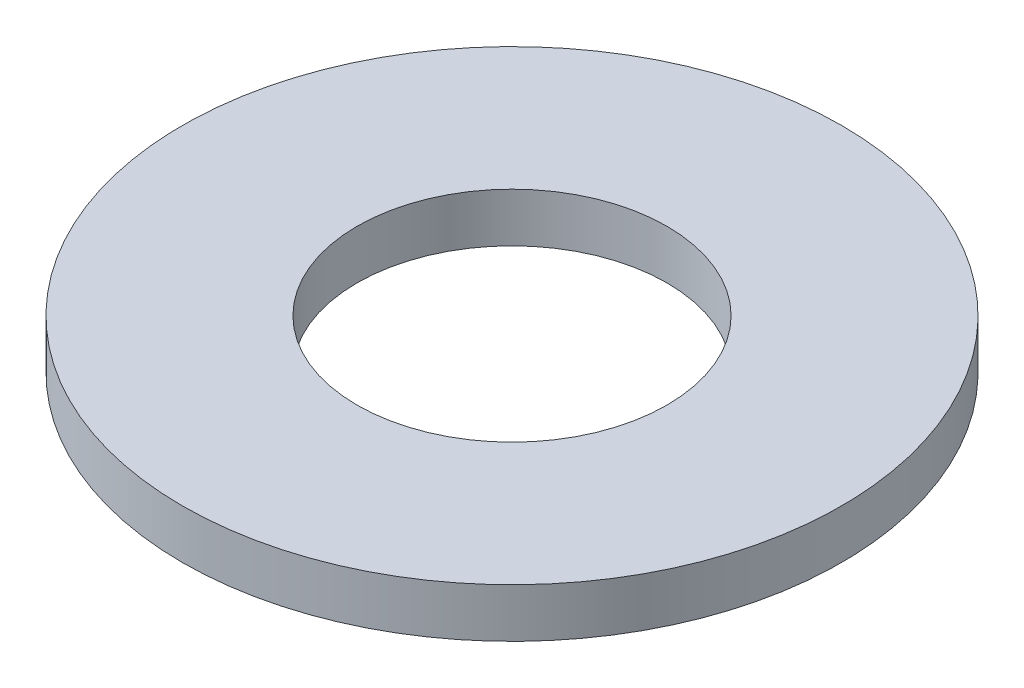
from build123d import *

# Parameters (mm, degrees)
SKETCH1_R           = 3.935
SKETCH1_R_2         = 1.85
BOSS_EXTRUDE1_DEPTH = 0.586


with BuildPart() as part:
    # Sketch1 → Boss-Extrude1 (new body)
    with BuildSketch(Plane(origin=(0, 0, 0), x_dir=(1, 0, 0), z_dir=(0, 1, 0))):
        with Locations(Location((0, 0, 0), (0, 0, 270))):
            Circle(SKETCH1_R)
        with Locations(Location((0, 0, 0), (0, 0, 270))):
            Circle(SKETCH1_R_2, mode=Mode.SUBTRACT)
    extrude(amount=BOSS_EXTRUDE1_DEPTH)


solid = part.part
